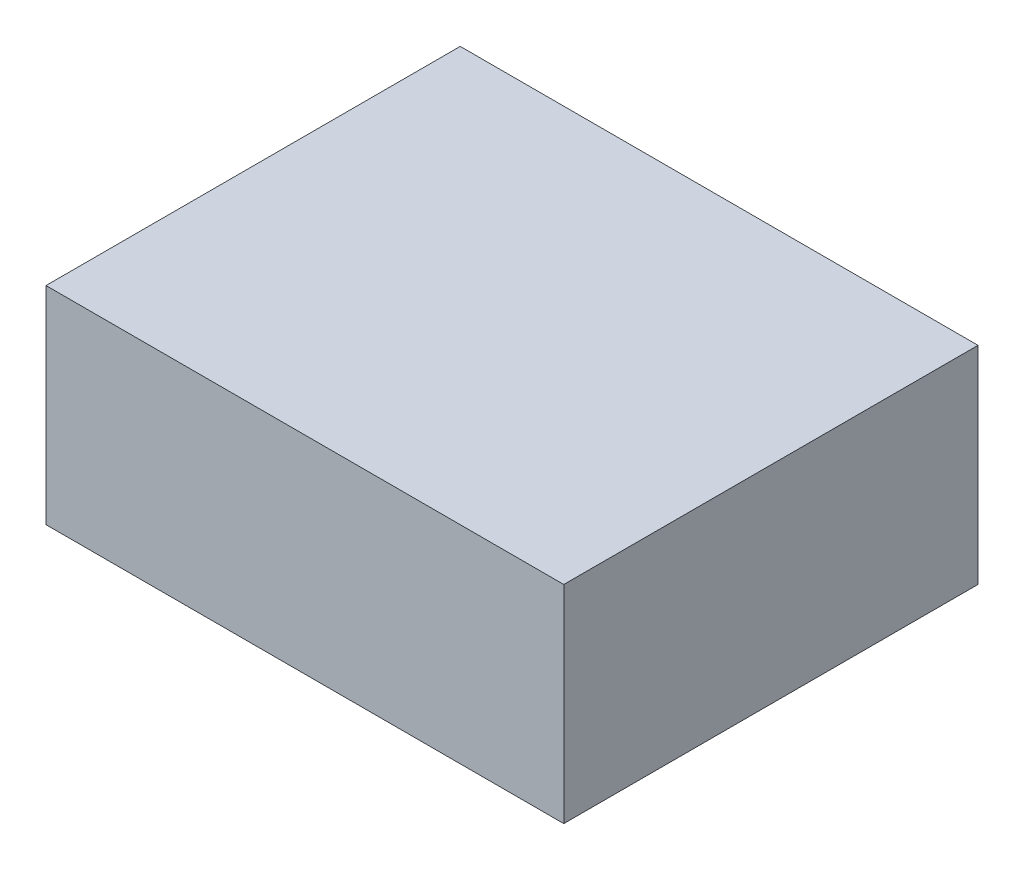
ISO-10303-21;
HEADER;
FILE_DESCRIPTION(('STEP AP214'),'2;1');
FILE_NAME('part.step','',(''),(''),'','','');
FILE_SCHEMA(('AUTOMOTIVE_DESIGN { 1 0 10303 214 1 1 1 1 }'));
ENDSEC;
DATA;
#1=APPLICATION_CONTEXT('core data for automotive mechanical design processes');
#2=APPLICATION_PROTOCOL_DEFINITION('international standard','automotive_design',2000,#1);
#3=PRODUCT_CONTEXT('',#1,'mechanical');
#4=PRODUCT('Part','Part','',(#3));
#5=PRODUCT_RELATED_PRODUCT_CATEGORY('part','',(#4));
#6=PRODUCT_DEFINITION_FORMATION('','',#4);
#7=PRODUCT_DEFINITION_CONTEXT('part definition',#1,'design');
#8=PRODUCT_DEFINITION('design','',#6,#7);
#9=PRODUCT_DEFINITION_SHAPE('','',#8);
#10=(LENGTH_UNIT() NAMED_UNIT(*) SI_UNIT(.MILLI.,.METRE.));
#11=(NAMED_UNIT(*) PLANE_ANGLE_UNIT() SI_UNIT($,.RADIAN.));
#12=(NAMED_UNIT(*) SI_UNIT($,.STERADIAN.) SOLID_ANGLE_UNIT());
#13=UNCERTAINTY_MEASURE_WITH_UNIT(LENGTH_MEASURE(1.E-05),#10,'distance_accuracy_value','');
#14=(GEOMETRIC_REPRESENTATION_CONTEXT(3) GLOBAL_UNCERTAINTY_ASSIGNED_CONTEXT((#13)) GLOBAL_UNIT_ASSIGNED_CONTEXT((#10,
#11,#12)) REPRESENTATION_CONTEXT('',''));
#15=CARTESIAN_POINT('',(0.,0.,0.));
#16=DIRECTION('',(0.,0.,1.));
#17=DIRECTION('',(1.,0.,0.));
#18=AXIS2_PLACEMENT_3D('',#15,#16,#17);
#19=CARTESIAN_POINT('',(-0.635,0.254,0.));
#20=DIRECTION('',(0.,1.,0.));
#21=DIRECTION('',(0.,0.,1.));
#22=AXIS2_PLACEMENT_3D('',#19,#20,#21);
#23=PLANE('',#22);
#24=DIRECTION('',(0.,0.,-1.));
#25=VECTOR('',#24,1.);
#26=CARTESIAN_POINT('',(0.635,0.254,0.));
#27=LINE('',#26,#25);
#28=CARTESIAN_POINT('',(0.635,0.254,0.));
#29=VERTEX_POINT('',#28);
#30=CARTESIAN_POINT('',(0.635,0.254,1.016));
#31=VERTEX_POINT('',#30);
#32=EDGE_CURVE('E20',#29,#31,#27,.F.);
#33=ORIENTED_EDGE('',*,*,#32,.F.);
#34=DIRECTION('',(1.,0.,0.));
#35=VECTOR('',#34,1.);
#36=CARTESIAN_POINT('',(0.635,0.254,0.));
#37=LINE('',#36,#35);
#38=CARTESIAN_POINT('',(-0.635,0.254,0.));
#39=VERTEX_POINT('',#38);
#40=EDGE_CURVE('E79',#29,#39,#37,.F.);
#41=ORIENTED_EDGE('',*,*,#40,.T.);
#42=DIRECTION('',(0.,0.,1.));
#43=VECTOR('',#42,1.);
#44=CARTESIAN_POINT('',(-0.635,0.254,0.));
#45=LINE('',#44,#43);
#46=CARTESIAN_POINT('',(-0.635,0.254,1.016));
#47=VERTEX_POINT('',#46);
#48=EDGE_CURVE('E61',#47,#39,#45,.F.);
#49=ORIENTED_EDGE('',*,*,#48,.F.);
#50=DIRECTION('',(1.,0.,0.));
#51=VECTOR('',#50,1.);
#52=CARTESIAN_POINT('',(0.635,0.254,1.016));
#53=LINE('',#52,#51);
#54=EDGE_CURVE('E56',#31,#47,#53,.F.);
#55=ORIENTED_EDGE('',*,*,#54,.F.);
#56=EDGE_LOOP('',(#33,#41,#49,#55));
#57=FACE_BOUND('',#56,.T.);
#58=ADVANCED_FACE('F17',(#57),#23,.T.);
#59=CARTESIAN_POINT('',(0.635,0.254,0.));
#60=DIRECTION('',(1.,0.,0.));
#61=DIRECTION('',(0.,0.,-1.));
#62=AXIS2_PLACEMENT_3D('',#59,#60,#61);
#63=PLANE('',#62);
#64=DIRECTION('',(0.,0.,-1.));
#65=VECTOR('',#64,1.);
#66=CARTESIAN_POINT('',(0.635,-0.254,0.));
#67=LINE('',#66,#65);
#68=CARTESIAN_POINT('',(0.635,-0.254,0.));
#69=VERTEX_POINT('',#68);
#70=CARTESIAN_POINT('',(0.635,-0.254,1.016));
#71=VERTEX_POINT('',#70);
#72=EDGE_CURVE('E83',#69,#71,#67,.F.);
#73=ORIENTED_EDGE('',*,*,#72,.F.);
#74=DIRECTION('',(0.,1.,0.));
#75=VECTOR('',#74,1.);
#76=CARTESIAN_POINT('',(0.635,0.254,0.));
#77=LINE('',#76,#75);
#78=EDGE_CURVE('E68',#69,#29,#77,.T.);
#79=ORIENTED_EDGE('',*,*,#78,.T.);
#80=ORIENTED_EDGE('',*,*,#32,.T.);
#81=DIRECTION('',(0.,1.,0.));
#82=VECTOR('',#81,1.);
#83=CARTESIAN_POINT('',(0.635,0.254,1.016));
#84=LINE('',#83,#82);
#85=EDGE_CURVE('E63',#71,#31,#84,.T.);
#86=ORIENTED_EDGE('',*,*,#85,.F.);
#87=EDGE_LOOP('',(#73,#79,#80,#86));
#88=FACE_BOUND('',#87,.T.);
#89=ADVANCED_FACE('F65',(#88),#63,.T.);
#90=CARTESIAN_POINT('',(0.635,0.254,1.016));
#91=DIRECTION('',(0.,0.,1.));
#92=DIRECTION('',(1.,0.,0.));
#93=AXIS2_PLACEMENT_3D('',#90,#91,#92);
#94=PLANE('',#93);
#95=DIRECTION('',(1.,0.,0.));
#96=VECTOR('',#95,1.);
#97=CARTESIAN_POINT('',(0.635,-0.254,1.016));
#98=LINE('',#97,#96);
#99=CARTESIAN_POINT('',(-0.635,-0.254,1.016));
#100=VERTEX_POINT('',#99);
#101=EDGE_CURVE('E72',#71,#100,#98,.F.);
#102=ORIENTED_EDGE('',*,*,#101,.F.);
#103=ORIENTED_EDGE('',*,*,#85,.T.);
#104=ORIENTED_EDGE('',*,*,#54,.T.);
#105=DIRECTION('',(0.,1.,0.));
#106=VECTOR('',#105,1.);
#107=CARTESIAN_POINT('',(-0.635,-0.254,1.016));
#108=LINE('',#107,#106);
#109=EDGE_CURVE('E74',#100,#47,#108,.T.);
#110=ORIENTED_EDGE('',*,*,#109,.F.);
#111=EDGE_LOOP('',(#102,#103,#104,#110));
#112=FACE_BOUND('',#111,.T.);
#113=ADVANCED_FACE('F70',(#112),#94,.T.);
#114=CARTESIAN_POINT('',(-0.635,-0.254,0.));
#115=DIRECTION('',(-1.,0.,0.));
#116=DIRECTION('',(0.,0.,1.));
#117=AXIS2_PLACEMENT_3D('',#114,#115,#116);
#118=PLANE('',#117);
#119=ORIENTED_EDGE('',*,*,#48,.T.);
#120=DIRECTION('',(0.,1.,0.));
#121=VECTOR('',#120,1.);
#122=CARTESIAN_POINT('',(-0.635,0.254,0.));
#123=LINE('',#122,#121);
#124=CARTESIAN_POINT('',(-0.635,-0.254,0.));
#125=VERTEX_POINT('',#124);
#126=EDGE_CURVE('E35',#39,#125,#123,.F.);
#127=ORIENTED_EDGE('',*,*,#126,.T.);
#128=DIRECTION('',(0.,0.,-1.));
#129=VECTOR('',#128,1.);
#130=CARTESIAN_POINT('',(-0.635,-0.254,0.));
#131=LINE('',#130,#129);
#132=EDGE_CURVE('E26',#100,#125,#131,.T.);
#133=ORIENTED_EDGE('',*,*,#132,.F.);
#134=ORIENTED_EDGE('',*,*,#109,.T.);
#135=EDGE_LOOP('',(#119,#127,#133,#134));
#136=FACE_BOUND('',#135,.T.);
#137=ADVANCED_FACE('F89',(#136),#118,.T.);
#138=CARTESIAN_POINT('',(0.635,0.254,0.));
#139=DIRECTION('',(0.,0.,1.));
#140=DIRECTION('',(1.,0.,0.));
#141=AXIS2_PLACEMENT_3D('',#138,#139,#140);
#142=PLANE('',#141);
#143=DIRECTION('',(1.,0.,0.));
#144=VECTOR('',#143,1.);
#145=CARTESIAN_POINT('',(0.635,-0.254,0.));
#146=LINE('',#145,#144);
#147=EDGE_CURVE('E11',#125,#69,#146,.T.);
#148=ORIENTED_EDGE('',*,*,#147,.F.);
#149=ORIENTED_EDGE('',*,*,#126,.F.);
#150=ORIENTED_EDGE('',*,*,#40,.F.);
#151=ORIENTED_EDGE('',*,*,#78,.F.);
#152=EDGE_LOOP('',(#148,#149,#150,#151));
#153=FACE_BOUND('',#152,.T.);
#154=ADVANCED_FACE('F91',(#153),#142,.F.);
#155=CARTESIAN_POINT('',(0.635,-0.254,0.));
#156=DIRECTION('',(0.,-1.,0.));
#157=DIRECTION('',(0.,0.,-1.));
#158=AXIS2_PLACEMENT_3D('',#155,#156,#157);
#159=PLANE('',#158);
#160=ORIENTED_EDGE('',*,*,#132,.T.);
#161=ORIENTED_EDGE('',*,*,#147,.T.);
#162=ORIENTED_EDGE('',*,*,#72,.T.);
#163=ORIENTED_EDGE('',*,*,#101,.T.);
#164=EDGE_LOOP('',(#160,#161,#162,#163));
#165=FACE_BOUND('',#164,.T.);
#166=ADVANCED_FACE('F88',(#165),#159,.T.);
#167=CLOSED_SHELL('',(#58,#89,#113,#137,#154,#166));
#168=MANIFOLD_SOLID_BREP('B1',#167);
#169=ADVANCED_BREP_SHAPE_REPRESENTATION('',(#18,#168),#14);
#170=SHAPE_DEFINITION_REPRESENTATION(#9,#169);
ENDSEC;
END-ISO-10303-21;
